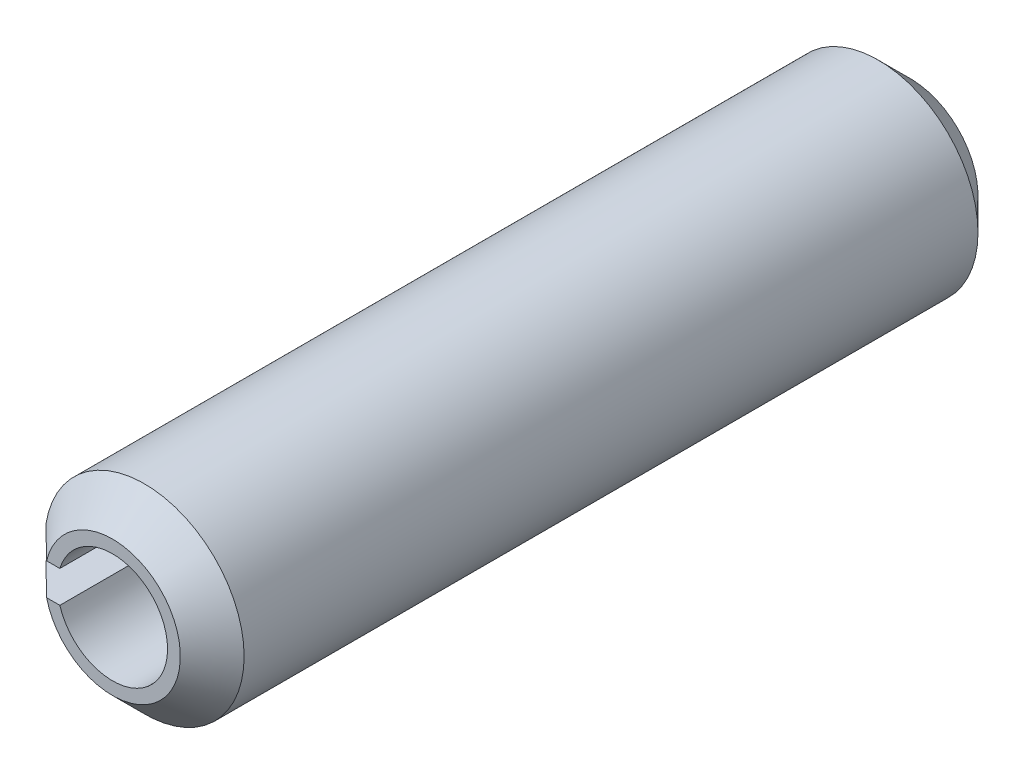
from build123d import *

# Parameters (mm, degrees)
BOSS_EXTRUDE1_DEPTH = 6.35
CHAMFER2_SIZE       = 0.508


with BuildPart() as part:
    # Sketch1 → Boss-Extrude1 (new, symmetric)
    with BuildSketch(Plane.XY):
        with BuildLine():
            Line((-0.838680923, 0.254), (-1.56704826, 0.254))
            ThreePointArc((-1.56704826, 0.254), (1.5875, 0), (-1.56704826, -0.254))
            Line((-1.56704826, -0.254), (-0.838680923, -0.254))
            ThreePointArc((-0.838680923, -0.254), (0.8763, 0), (-0.838680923, 0.254))
        make_face()
    extrude(amount=BOSS_EXTRUDE1_DEPTH, both=True)

    # Chamfer2
    chamfer2_edges = [part.edges().sort_by_distance(p)[0] for p in [
        (1.5875, 0, 6.35),
        (1.5875, 0, -6.35),
    ]]
    chamfer(chamfer2_edges, length=CHAMFER2_SIZE)


solid = part.part
